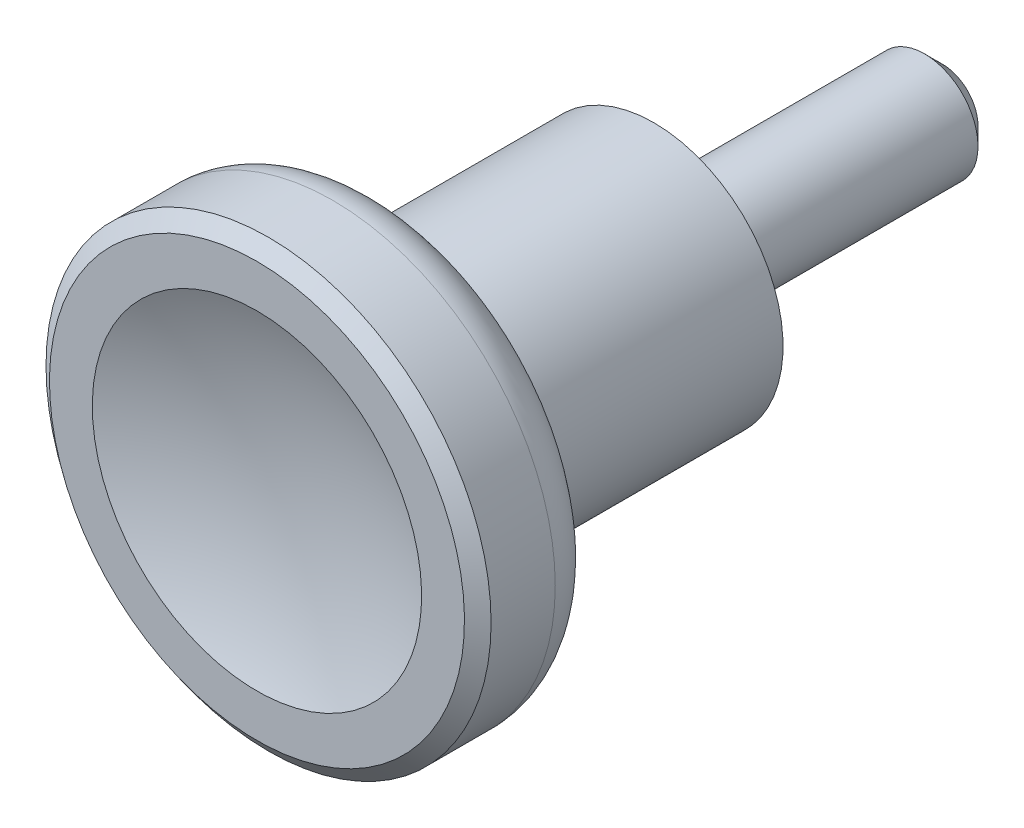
ISO-10303-21;
HEADER;
FILE_DESCRIPTION(('STEP AP214'),'2;1');
FILE_NAME('part.step','',(''),(''),'','','');
FILE_SCHEMA(('AUTOMOTIVE_DESIGN { 1 0 10303 214 1 1 1 1 }'));
ENDSEC;
DATA;
#1=APPLICATION_CONTEXT('core data for automotive mechanical design processes');
#2=APPLICATION_PROTOCOL_DEFINITION('international standard','automotive_design',2000,#1);
#3=PRODUCT_CONTEXT('',#1,'mechanical');
#4=PRODUCT('Part','Part','',(#3));
#5=PRODUCT_RELATED_PRODUCT_CATEGORY('part','',(#4));
#6=PRODUCT_DEFINITION_FORMATION('','',#4);
#7=PRODUCT_DEFINITION_CONTEXT('part definition',#1,'design');
#8=PRODUCT_DEFINITION('design','',#6,#7);
#9=PRODUCT_DEFINITION_SHAPE('','',#8);
#10=(LENGTH_UNIT() NAMED_UNIT(*) SI_UNIT(.MILLI.,.METRE.));
#11=(NAMED_UNIT(*) PLANE_ANGLE_UNIT() SI_UNIT($,.RADIAN.));
#12=(NAMED_UNIT(*) SI_UNIT($,.STERADIAN.) SOLID_ANGLE_UNIT());
#13=UNCERTAINTY_MEASURE_WITH_UNIT(LENGTH_MEASURE(1.E-05),#10,'distance_accuracy_value','');
#14=(GEOMETRIC_REPRESENTATION_CONTEXT(3) GLOBAL_UNCERTAINTY_ASSIGNED_CONTEXT((#13)) GLOBAL_UNIT_ASSIGNED_CONTEXT((#10,
#11,#12)) REPRESENTATION_CONTEXT('',''));
#15=CARTESIAN_POINT('',(0.,0.,0.));
#16=DIRECTION('',(0.,0.,1.));
#17=DIRECTION('',(1.,0.,0.));
#18=AXIS2_PLACEMENT_3D('',#15,#16,#17);
#19=CARTESIAN_POINT('',(0.,0.,43.6847281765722));
#20=DIRECTION('',(0.,-1.,0.));
#21=DIRECTION('',(1.,0.,0.));
#22=AXIS2_PLACEMENT_3D('',#19,#20,#21);
#23=SPHERICAL_SURFACE('',#22,23.1163945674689);
#24=CARTESIAN_POINT('',(0.,0.,43.6847281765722));
#25=DIRECTION('',(0.,0.,-1.));
#26=DIRECTION('',(0.,1.,0.));
#27=AXIS2_PLACEMENT_3D('',#24,#25,#26);
#28=SPHERICAL_SURFACE('',#27,23.1163945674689);
#29=CARTESIAN_POINT('',(0.,0.,22.4988392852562));
#30=DIRECTION('',(0.,0.,-1.));
#31=DIRECTION('',(0.,1.,0.));
#32=AXIS2_PLACEMENT_3D('',#29,#30,#31);
#33=CIRCLE('',#32,9.24801652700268);
#34=CARTESIAN_POINT('',(0.,9.24801652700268,22.4988392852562));
#35=VERTEX_POINT('',#34);
#36=EDGE_CURVE('E56',#35,#35,#33,.T.);
#37=ORIENTED_EDGE('',*,*,#36,.F.);
#38=EDGE_LOOP('',(#37));
#39=FACE_BOUND('',#38,.T.);
#40=ADVANCED_FACE('F12',(#39),#28,.F.);
#41=CARTESIAN_POINT('',(3.,0.,-16.));
#42=DIRECTION('',(0.,0.,1.));
#43=DIRECTION('',(0.,-1.,0.));
#44=AXIS2_PLACEMENT_3D('',#41,#42,#43);
#45=PLANE('',#44);
#46=CARTESIAN_POINT('',(0.,0.,-16.));
#47=DIRECTION('',(0.,0.,1.));
#48=DIRECTION('',(1.,0.,0.));
#49=AXIS2_PLACEMENT_3D('',#46,#47,#48);
#50=CIRCLE('',#49,2.);
#51=CARTESIAN_POINT('',(2.,0.,-16.));
#52=VERTEX_POINT('',#51);
#53=EDGE_CURVE('E19',#52,#52,#50,.F.);
#54=ORIENTED_EDGE('',*,*,#53,.T.);
#55=EDGE_LOOP('',(#54));
#56=FACE_BOUND('',#55,.T.);
#57=ADVANCED_FACE('F63',(#56),#45,.F.);
#58=CARTESIAN_POINT('',(0.,0.,-2.38339822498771));
#59=DIRECTION('',(0.,0.,-1.));
#60=DIRECTION('',(0.,1.,0.));
#61=AXIS2_PLACEMENT_3D('',#58,#59,#60);
#62=CYLINDRICAL_SURFACE('',#61,3.);
#63=CARTESIAN_POINT('',(0.,0.,-15.));
#64=DIRECTION('',(0.,0.,1.));
#65=DIRECTION('',(1.,0.,0.));
#66=AXIS2_PLACEMENT_3D('',#63,#64,#65);
#67=CIRCLE('',#66,3.);
#68=CARTESIAN_POINT('',(3.,0.,-15.));
#69=VERTEX_POINT('',#68);
#70=EDGE_CURVE('E8',#69,#69,#67,.T.);
#71=ORIENTED_EDGE('',*,*,#70,.T.);
#72=EDGE_LOOP('',(#71));
#73=FACE_BOUND('',#72,.T.);
#74=CARTESIAN_POINT('',(0.,0.,0.));
#75=DIRECTION('',(0.,0.,-1.));
#76=DIRECTION('',(0.,1.,0.));
#77=AXIS2_PLACEMENT_3D('',#74,#75,#76);
#78=CIRCLE('',#77,3.);
#79=CARTESIAN_POINT('',(0.,3.,0.));
#80=VERTEX_POINT('',#79);
#81=EDGE_CURVE('E23',#80,#80,#78,.T.);
#82=ORIENTED_EDGE('',*,*,#81,.T.);
#83=EDGE_LOOP('',(#82));
#84=FACE_BOUND('',#83,.T.);
#85=ADVANCED_FACE('F69',(#73,#84),#62,.T.);
#86=CARTESIAN_POINT('',(3.,0.,0.));
#87=DIRECTION('',(0.,0.,-1.));
#88=DIRECTION('',(0.,1.,0.));
#89=AXIS2_PLACEMENT_3D('',#86,#87,#88);
#90=PLANE('',#89);
#91=CARTESIAN_POINT('',(0.,0.,0.));
#92=DIRECTION('',(0.,0.,-1.));
#93=DIRECTION('',(0.,1.,0.));
#94=AXIS2_PLACEMENT_3D('',#91,#92,#93);
#95=CIRCLE('',#94,4.5);
#96=CARTESIAN_POINT('',(0.,4.5,0.));
#97=VERTEX_POINT('',#96);
#98=EDGE_CURVE('E27',#97,#97,#95,.T.);
#99=ORIENTED_EDGE('',*,*,#98,.T.);
#100=EDGE_LOOP('',(#99));
#101=FACE_BOUND('',#100,.T.);
#102=ORIENTED_EDGE('',*,*,#81,.F.);
#103=EDGE_LOOP('',(#102));
#104=FACE_BOUND('',#103,.T.);
#105=ADVANCED_FACE('F74',(#101,#104),#90,.T.);
#106=CARTESIAN_POINT('',(0.,0.,-2.38339822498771));
#107=DIRECTION('',(0.,0.,-1.));
#108=DIRECTION('',(0.,1.,0.));
#109=AXIS2_PLACEMENT_3D('',#106,#107,#108);
#110=CYLINDRICAL_SURFACE('',#109,4.5);
#111=ORIENTED_EDGE('',*,*,#98,.F.);
#112=EDGE_LOOP('',(#111));
#113=FACE_BOUND('',#112,.T.);
#114=CARTESIAN_POINT('',(0.,0.,0.200000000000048));
#115=DIRECTION('',(0.,0.,-1.));
#116=DIRECTION('',(0.,1.,0.));
#117=AXIS2_PLACEMENT_3D('',#114,#115,#116);
#118=CIRCLE('',#117,4.5);
#119=CARTESIAN_POINT('',(0.,4.5,0.200000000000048));
#120=VERTEX_POINT('',#119);
#121=EDGE_CURVE('E32',#120,#120,#118,.T.);
#122=ORIENTED_EDGE('',*,*,#121,.T.);
#123=EDGE_LOOP('',(#122));
#124=FACE_BOUND('',#123,.T.);
#125=ADVANCED_FACE('F77',(#113,#124),#110,.T.);
#126=CARTESIAN_POINT('',(4.5000000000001,0.,0.200000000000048));
#127=DIRECTION('',(0.,0.,-1.));
#128=DIRECTION('',(0.,1.,0.));
#129=AXIS2_PLACEMENT_3D('',#126,#127,#128);
#130=PLANE('',#129);
#131=CARTESIAN_POINT('',(0.,0.,0.200000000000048));
#132=DIRECTION('',(0.,0.,-1.));
#133=DIRECTION('',(0.,1.,0.));
#134=AXIS2_PLACEMENT_3D('',#131,#132,#133);
#135=CIRCLE('',#134,7.25);
#136=CARTESIAN_POINT('',(0.,7.25,0.200000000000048));
#137=VERTEX_POINT('',#136);
#138=EDGE_CURVE('E35',#137,#137,#135,.T.);
#139=ORIENTED_EDGE('',*,*,#138,.T.);
#140=EDGE_LOOP('',(#139));
#141=FACE_BOUND('',#140,.T.);
#142=ORIENTED_EDGE('',*,*,#121,.F.);
#143=EDGE_LOOP('',(#142));
#144=FACE_BOUND('',#143,.T.);
#145=ADVANCED_FACE('F81',(#141,#144),#130,.T.);
#146=CARTESIAN_POINT('',(0.,0.,-2.38339822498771));
#147=DIRECTION('',(0.,0.,-1.));
#148=DIRECTION('',(0.,1.,0.));
#149=AXIS2_PLACEMENT_3D('',#146,#147,#148);
#150=CYLINDRICAL_SURFACE('',#149,7.25);
#151=CARTESIAN_POINT('',(0.,0.,14.));
#152=DIRECTION('',(0.,0.,-1.));
#153=DIRECTION('',(0.,1.,0.));
#154=AXIS2_PLACEMENT_3D('',#151,#152,#153);
#155=CIRCLE('',#154,7.25);
#156=CARTESIAN_POINT('',(0.,7.25,14.));
#157=VERTEX_POINT('',#156);
#158=EDGE_CURVE('E38',#157,#157,#155,.T.);
#159=ORIENTED_EDGE('',*,*,#158,.T.);
#160=EDGE_LOOP('',(#159));
#161=FACE_BOUND('',#160,.T.);
#162=ORIENTED_EDGE('',*,*,#138,.F.);
#163=EDGE_LOOP('',(#162));
#164=FACE_BOUND('',#163,.T.);
#165=ADVANCED_FACE('F85',(#161,#164),#150,.T.);
#166=CARTESIAN_POINT('',(0.,0.,14.));
#167=DIRECTION('',(0.,0.,-1.));
#168=DIRECTION('',(0.,1.,0.));
#169=AXIS2_PLACEMENT_3D('',#166,#167,#168);
#170=TOROIDAL_SURFACE('',#169,7.75,0.5);
#171=ORIENTED_EDGE('',*,*,#158,.F.);
#172=EDGE_LOOP('',(#171));
#173=FACE_BOUND('',#172,.T.);
#174=CARTESIAN_POINT('',(0.,0.,14.4670163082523));
#175=DIRECTION('',(0.,0.,-1.));
#176=DIRECTION('',(0.,1.,0.));
#177=AXIS2_PLACEMENT_3D('',#174,#175,#176);
#178=CIRCLE('',#177,7.57140613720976);
#179=CARTESIAN_POINT('',(0.,7.57140613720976,14.4670163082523));
#180=VERTEX_POINT('',#179);
#181=EDGE_CURVE('E41',#180,#180,#178,.T.);
#182=ORIENTED_EDGE('',*,*,#181,.T.);
#183=EDGE_LOOP('',(#182));
#184=FACE_BOUND('',#183,.T.);
#185=ADVANCED_FACE('F89',(#173,#184),#170,.F.);
#186=CARTESIAN_POINT('',(0.,0.,14.4670163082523));
#187=DIRECTION('',(0.,0.,1.));
#188=DIRECTION('',(0.,-1.,0.));
#189=AXIS2_PLACEMENT_3D('',#186,#187,#188);
#190=CONICAL_SURFACE('',#189,7.57140613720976,1.20554106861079);
#191=CARTESIAN_POINT('',(0.,0.,15.675774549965));
#192=DIRECTION('',(0.,0.,-1.));
#193=DIRECTION('',(0.,1.,0.));
#194=AXIS2_PLACEMENT_3D('',#191,#192,#193);
#195=CIRCLE('',#194,10.7322639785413);
#196=CARTESIAN_POINT('',(0.,10.7322639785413,15.675774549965));
#197=VERTEX_POINT('',#196);
#198=EDGE_CURVE('E44',#197,#197,#195,.T.);
#199=ORIENTED_EDGE('',*,*,#198,.T.);
#200=EDGE_LOOP('',(#199));
#201=FACE_BOUND('',#200,.T.);
#202=ORIENTED_EDGE('',*,*,#181,.F.);
#203=EDGE_LOOP('',(#202));
#204=FACE_BOUND('',#203,.T.);
#205=ADVANCED_FACE('F93',(#201,#204),#190,.T.);
#206=CARTESIAN_POINT('',(0.,0.,18.2443675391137));
#207=DIRECTION('',(0.,0.,-1.));
#208=DIRECTION('',(0.,1.,0.));
#209=AXIS2_PLACEMENT_3D('',#206,#207,#208);
#210=TOROIDAL_SURFACE('',#209,9.74999647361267,2.75000352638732);
#211=CARTESIAN_POINT('',(0.,0.,18.2443675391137));
#212=DIRECTION('',(0.,0.,-1.));
#213=DIRECTION('',(0.,1.,0.));
#214=AXIS2_PLACEMENT_3D('',#211,#212,#213);
#215=CIRCLE('',#214,12.5);
#216=CARTESIAN_POINT('',(0.,12.5,18.2443675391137));
#217=VERTEX_POINT('',#216);
#218=EDGE_CURVE('E47',#217,#217,#215,.T.);
#219=ORIENTED_EDGE('',*,*,#218,.T.);
#220=EDGE_LOOP('',(#219));
#221=FACE_BOUND('',#220,.T.);
#222=ORIENTED_EDGE('',*,*,#198,.F.);
#223=EDGE_LOOP('',(#222));
#224=FACE_BOUND('',#223,.T.);
#225=ADVANCED_FACE('F97',(#221,#224),#210,.T.);
#226=CARTESIAN_POINT('',(0.,0.,-2.38339822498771));
#227=DIRECTION('',(0.,0.,-1.));
#228=DIRECTION('',(0.,1.,0.));
#229=AXIS2_PLACEMENT_3D('',#226,#227,#228);
#230=CYLINDRICAL_SURFACE('',#229,12.5);
#231=ORIENTED_EDGE('',*,*,#218,.F.);
#232=EDGE_LOOP('',(#231));
#233=FACE_BOUND('',#232,.T.);
#234=CARTESIAN_POINT('',(0.,0.,21.8478667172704));
#235=DIRECTION('',(0.,0.,-1.));
#236=DIRECTION('',(0.,1.,0.));
#237=AXIS2_PLACEMENT_3D('',#234,#235,#236);
#238=CIRCLE('',#237,12.5);
#239=CARTESIAN_POINT('',(0.,12.5,21.8478667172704));
#240=VERTEX_POINT('',#239);
#241=EDGE_CURVE('E50',#240,#240,#238,.T.);
#242=ORIENTED_EDGE('',*,*,#241,.T.);
#243=EDGE_LOOP('',(#242));
#244=FACE_BOUND('',#243,.T.);
#245=ADVANCED_FACE('F101',(#233,#244),#230,.T.);
#246=CARTESIAN_POINT('',(0.,0.,22.4983919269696));
#247=DIRECTION('',(0.,0.,-1.));
#248=DIRECTION('',(0.,1.,0.));
#249=AXIS2_PLACEMENT_3D('',#246,#247,#248);
#250=CONICAL_SURFACE('',#249,11.6552976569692,0.914540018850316);
#251=ORIENTED_EDGE('',*,*,#241,.F.);
#252=EDGE_LOOP('',(#251));
#253=FACE_BOUND('',#252,.T.);
#254=CARTESIAN_POINT('',(0.,0.,22.4983919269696));
#255=DIRECTION('',(0.,0.,-1.));
#256=DIRECTION('',(0.,1.,0.));
#257=AXIS2_PLACEMENT_3D('',#254,#255,#256);
#258=CIRCLE('',#257,11.6552976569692);
#259=CARTESIAN_POINT('',(0.,11.6552976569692,22.4983919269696));
#260=VERTEX_POINT('',#259);
#261=EDGE_CURVE('E53',#260,#260,#258,.T.);
#262=ORIENTED_EDGE('',*,*,#261,.T.);
#263=EDGE_LOOP('',(#262));
#264=FACE_BOUND('',#263,.T.);
#265=ADVANCED_FACE('F105',(#253,#264),#250,.T.);
#266=CARTESIAN_POINT('',(0.,0.,22.4988392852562));
#267=DIRECTION('',(0.,0.,-1.));
#268=DIRECTION('',(0.,1.,0.));
#269=AXIS2_PLACEMENT_3D('',#266,#267,#268);
#270=CONICAL_SURFACE('',#269,9.24801652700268,1.57061049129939);
#271=ORIENTED_EDGE('',*,*,#261,.F.);
#272=EDGE_LOOP('',(#271));
#273=FACE_BOUND('',#272,.T.);
#274=ORIENTED_EDGE('',*,*,#36,.T.);
#275=EDGE_LOOP('',(#274));
#276=FACE_BOUND('',#275,.T.);
#277=ADVANCED_FACE('F60',(#273,#276),#270,.T.);
#278=CARTESIAN_POINT('',(0.,0.,-16.));
#279=DIRECTION('',(0.,0.,1.));
#280=DIRECTION('',(1.,0.,0.));
#281=AXIS2_PLACEMENT_3D('',#278,#279,#280);
#282=CONICAL_SURFACE('',#281,2.,0.785398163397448);
#283=ORIENTED_EDGE('',*,*,#70,.F.);
#284=EDGE_LOOP('',(#283));
#285=FACE_BOUND('',#284,.T.);
#286=ORIENTED_EDGE('',*,*,#53,.F.);
#287=EDGE_LOOP('',(#286));
#288=FACE_BOUND('',#287,.T.);
#289=ADVANCED_FACE('F14',(#285,#288),#282,.T.);
#290=CLOSED_SHELL('',(#40,#57,#85,#105,#125,#145,#165,#185,#205,#225,#245,#265,#277,#289));
#291=MANIFOLD_SOLID_BREP('B1',#290);
#292=ADVANCED_BREP_SHAPE_REPRESENTATION('',(#18,#291),#14);
#293=SHAPE_DEFINITION_REPRESENTATION(#9,#292);
ENDSEC;
END-ISO-10303-21;
